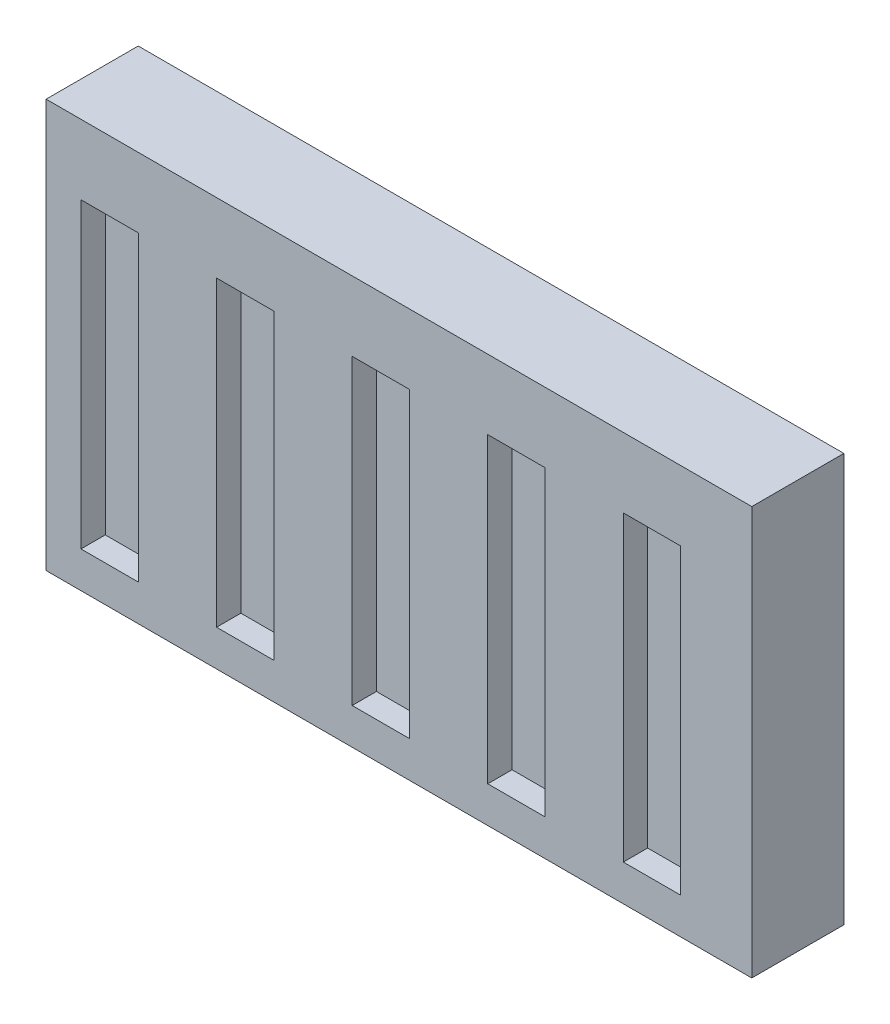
from build123d import *

# Parameters (mm, degrees)
SKETCH1_W          = 124.900826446
SKETCH1_H          = 72.264049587
EXTRUDE1_DEPTH     = 16.3
SKETCH2_W          = 10.160814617
SKETCH2_H          = 53.527056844
CUT_EXTRUDE1_DEPTH = 4.3
LPATTERN1_COUNT    = 5
LPATTERN1_PITCH    = 24


with BuildPart() as part:
    # Sketch1 → Extrude1 (new body)
    with BuildSketch(Plane.XY):
        with Locations((62.450413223, 36.132024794)):
            Rectangle(SKETCH1_W, SKETCH1_H)
    extrude(amount=EXTRUDE1_DEPTH)

    # Sketch2 → Cut-Extrude1 (cut)
    with BuildSketch(Plane.XY.offset(16.3)):
        with Locations((11.247386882, 33.165748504)):
            Rectangle(SKETCH2_W, SKETCH2_H)
    cut_extrude1 = extrude(amount=-CUT_EXTRUDE1_DEPTH, mode=Mode.SUBTRACT)

    # LPattern1: Cut-Extrude1 ×5
    with Locations(*[(i * LPATTERN1_PITCH, 0, 0) for i in range(1, LPATTERN1_COUNT)]):
        add(cut_extrude1, mode=Mode.SUBTRACT)


solid = part.part
